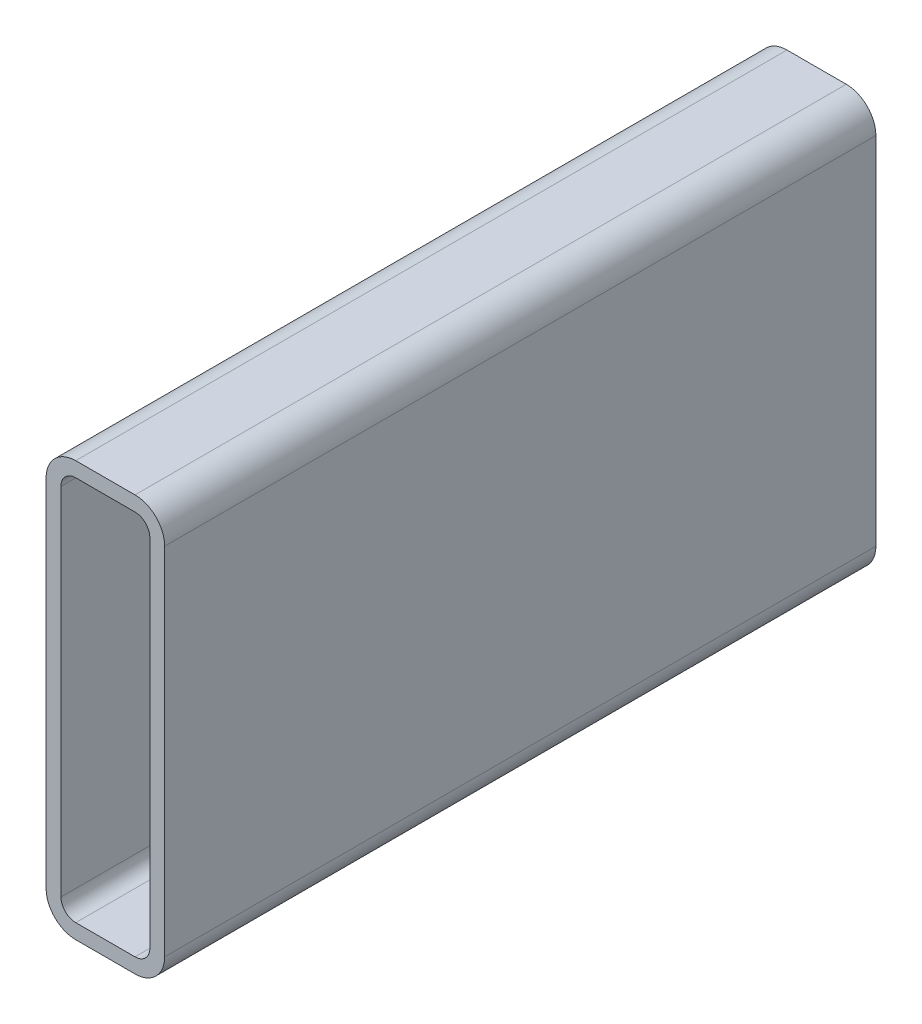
from build123d import *

# Parameters (mm, degrees)
BOSS_EXTRUDE1_DEPTH = 304.8


with BuildPart() as part:
    # Sketch1 → Boss-Extrude1 (new body)
    with BuildSketch(Plane.XY):
        with BuildLine():
            Line((12.7, 177.8), (38.1, 177.8))
            ThreePointArc((38.1, 177.8), (47.080256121, 174.080256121), (50.8, 165.1))
            Line((50.8, 165.1), (50.8, 12.7))
            ThreePointArc((50.8, 12.7), (47.080256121, 3.719743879), (38.1, 0))
            Line((38.1, 0), (12.7, 0))
            ThreePointArc((12.7, 0), (3.719743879, 3.719743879), (0, 12.7))
            Line((0, 12.7), (0, 165.1))
            ThreePointArc((0, 165.1), (3.719743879, 174.080256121), (12.7, 177.8))
        make_face()
        with BuildLine():
            Line((12.7, 171.45), (38.1, 171.45))
            ThreePointArc((38.1, 171.45), (42.590128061, 169.590128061), (44.45, 165.1))
            Line((44.45, 165.1), (44.45, 12.7))
            ThreePointArc((44.45, 12.7), (42.590128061, 8.209871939), (38.1, 6.35))
            Line((38.1, 6.35), (12.7, 6.35))
            ThreePointArc((12.7, 6.35), (8.209871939, 8.209871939), (6.35, 12.7))
            Line((6.35, 12.7), (6.35, 165.1))
            ThreePointArc((6.35, 165.1), (8.209871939, 169.590128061), (12.7, 171.45))
        make_face(mode=Mode.SUBTRACT)
    extrude(amount=BOSS_EXTRUDE1_DEPTH)


solid = part.part
